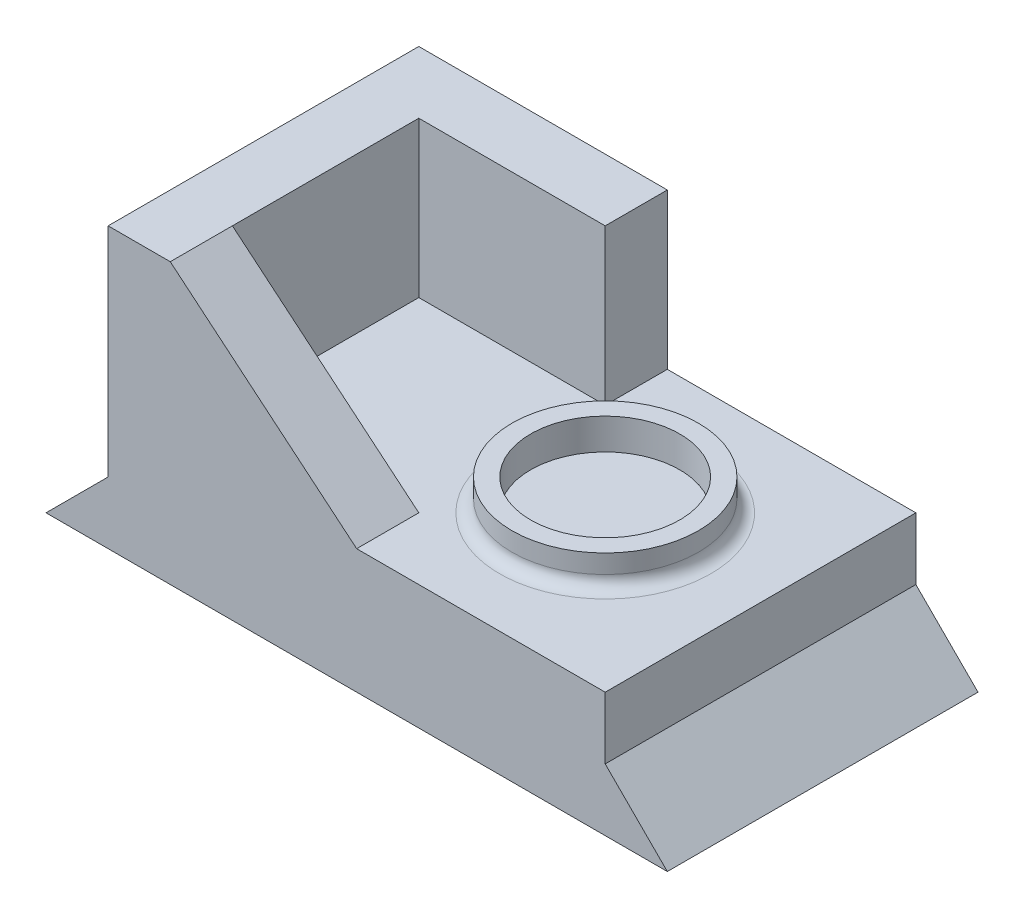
from build123d import *

# Parameters (mm, degrees)
BOSS_EXTRU_1_DEPTH      = 25
BOSS_EXTRU_3_DEPTH      = 10
ESQUISSE3_R             = 15
ESQUISSE3_R_2           = 12
BOSS_EXTRU_4_DEPTH      = 5
ESQUISSE4_W             = 30
ESQUISSE4_H             = 30
ENL_V_MAT_EXTRU_1_DEPTH = 25
CONG_2_R                = 2


with BuildPart() as part:
    # Esquisse1 → Boss.-Extru.1 (new, symmetric)
    with BuildSketch(Plane.XY):
        Polygon((51.416041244, 0), (-48.583958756, 0), (-38.583958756, 10), (-38.583958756, 45), (-28.583958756, 45), (1.416041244, 20), (41.416041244, 20), (41.416041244, 10), align=None)
    extrude(amount=BOSS_EXTRU_1_DEPTH, both=True)

    # Esquisse2 → Boss.-Extru.3 (add)
    with BuildSketch(Plane(origin=(0, 0, -25), x_dir=(-1, 0, 0), z_dir=(0, 0, -1))):
        Polygon((-1.416041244, 20), (28.583958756, 45), (-1.416041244, 45), align=None)
    extrude(amount=-BOSS_EXTRU_3_DEPTH)

    # Esquisse3 → Boss.-Extru.4 (add)
    with BuildSketch(Plane(origin=(0, 20, 0), x_dir=(1, 0, 0), z_dir=(0, 1, 0))):
        with Locations(Location((16.416041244, 0, 0), (0, 0, 180))):
            Circle(ESQUISSE3_R)
        with Locations(Location((16.416041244, 0, 0), (0, 0, 270))):
            Circle(ESQUISSE3_R_2, mode=Mode.SUBTRACT)
    extrude(amount=BOSS_EXTRU_4_DEPTH)

    # Esquisse4 → Enl_v. mat.-Extru.1 (cut)
    with BuildSketch(Plane(origin=(0, 45, 0), x_dir=(1, 0, 0), z_dir=(0, 1, 0))):
        with Locations((-13.583958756, 0)):
            Rectangle(ESQUISSE4_W, ESQUISSE4_H)
    extrude(amount=-ENL_V_MAT_EXTRU_1_DEPTH, mode=Mode.SUBTRACT)

    # Cong_2
    cong_2_edges = [part.edges().sort_by_distance(p)[0] for p in [
        (31.416041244, 20, 0),
    ]]
    fillet(cong_2_edges, radius=CONG_2_R)


solid = part.part
